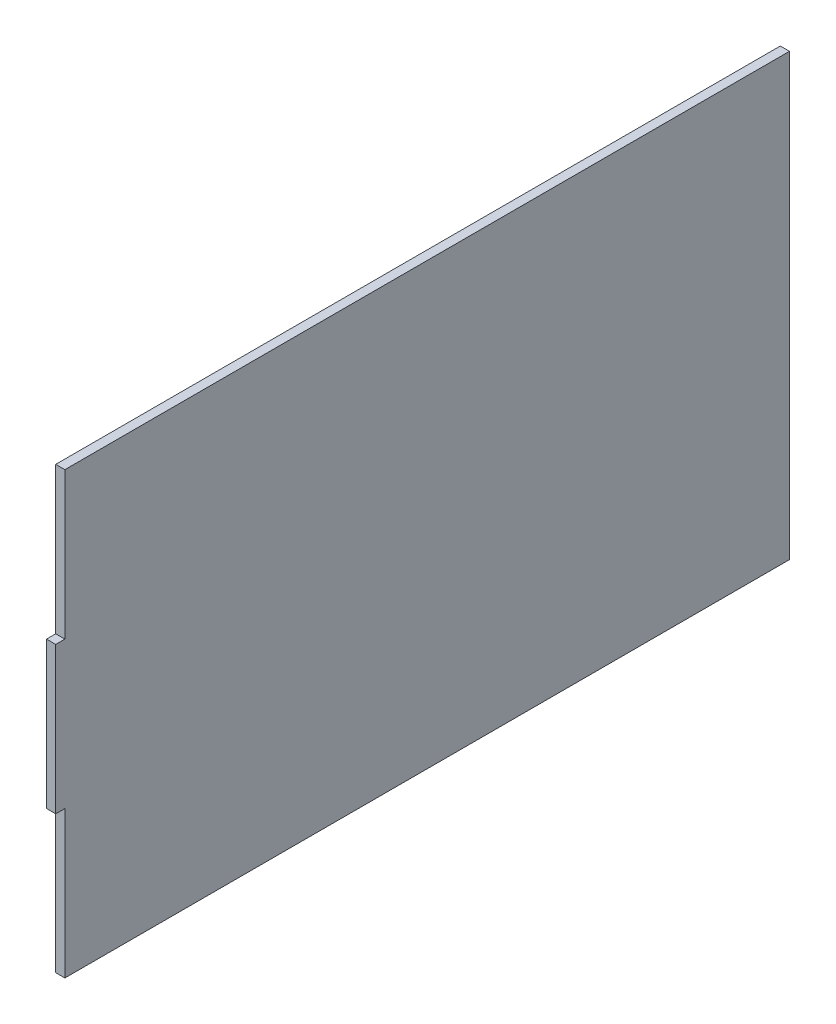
from build123d import *

# Parameters (mm, degrees)
SKETCH1_W           = 3.175
SKETCH1_H           = 254
BOSS_EXTRUDE1_DEPTH = 152.4
SKETCH2_W           = 244.475
SKETCH2_H           = 25.4
CUT_EXTRUDE1_DEPTH  = 1.5875
SKETCH3_W           = 3.175
SKETCH3_H           = 50.8
CUT_EXTRUDE2_DEPTH  = 199.40574746


with BuildPart() as part:
    # Sketch1 → Boss-Extrude1 (new body)
    with BuildSketch(Plane(origin=(0, 0, 0), x_dir=(1, 0, 0), z_dir=(0, 1, 0))):
        Rectangle(SKETCH1_W, SKETCH1_H)
    extrude(amount=BOSS_EXTRUDE1_DEPTH)

    # Sketch2 → Cut-Extrude1 (cut)
    with BuildSketch(Plane.ZY.offset(1.5875)):
        with Locations((-4.7625, 50.8)):
            Rectangle(SKETCH2_W, SKETCH2_H)
    extrude(amount=-CUT_EXTRUDE1_DEPTH, mode=Mode.SUBTRACT)

    # Sketch3 → Cut-Extrude2 (cut, through all)
    with BuildSketch(Plane.ZY.offset(1.5875)):
        with Locations((125.4125, 25.4)):
            Rectangle(SKETCH3_W, SKETCH3_H)
        with Locations((125.4125, 127)):
            Rectangle(SKETCH3_W, SKETCH3_H)
    extrude(amount=-CUT_EXTRUDE2_DEPTH, mode=Mode.SUBTRACT)


solid = part.part
